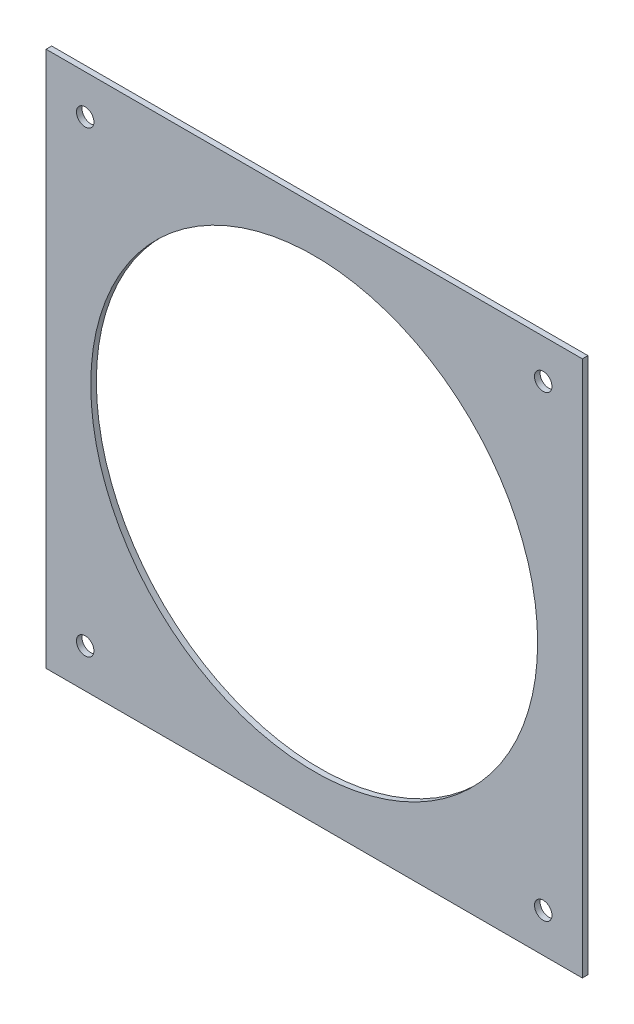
from build123d import *

# Parameters (mm, degrees)
SKETCH1_W                        = 304.8
SKETCH1_H                        = 304.8
SKETCH1_R                        = 127
BOSS_EXTRUDE1_DEPTH              = 3.175
F_25_64_0_39063_DIAMETER_HOLE1_D = 9.922002


with BuildPart() as part:
    # Sketch1 → Boss-Extrude1 (new body)
    with BuildSketch(Plane.XY):
        with Locations((152.4, 152.4)):
            Rectangle(SKETCH1_W, SKETCH1_H)
        with Locations((152.4, 152.4)):
            Circle(SKETCH1_R, mode=Mode.SUBTRACT)
    extrude(amount=BOSS_EXTRUDE1_DEPTH)

    # 25_64 _0.39063_ Diameter Hole1 (through all)
    with Locations(Plane.XY.offset(3.175)):
        with Locations((22.225, 282.575), (282.575, 282.575), (282.575, 22.225), (22.225, 22.225)):
            Hole(F_25_64_0_39063_DIAMETER_HOLE1_D / 2)


solid = part.part
